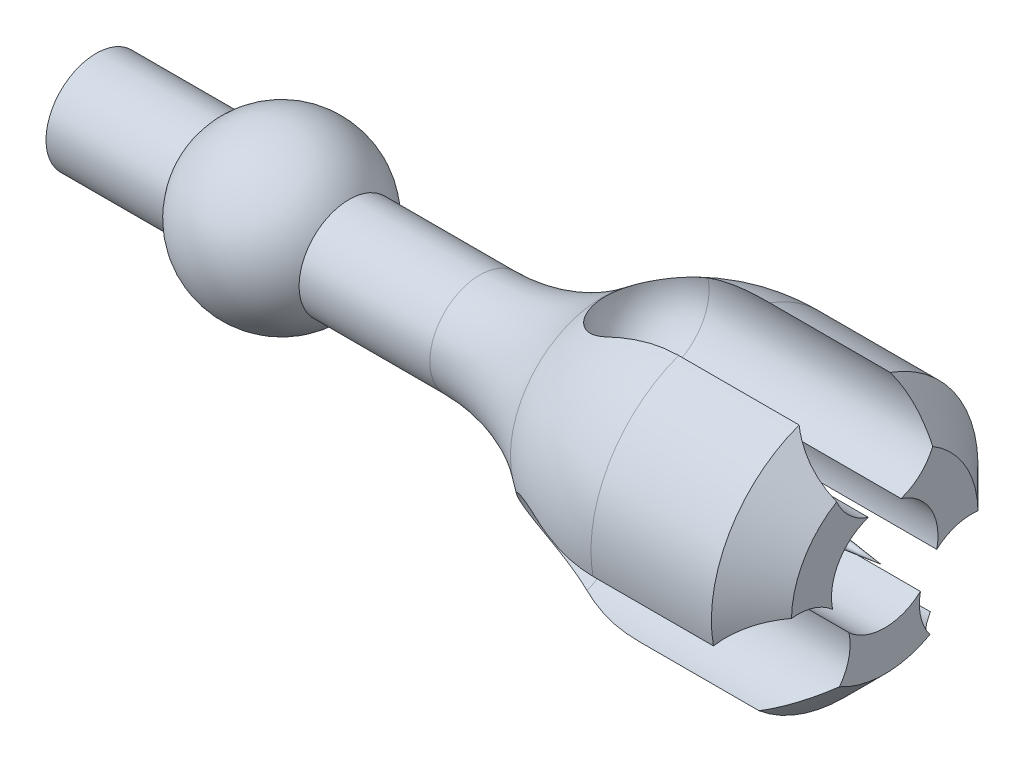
from build123d import *

# Parameters (mm, degrees)
R_P_TITION_CIRCULAIRE1_COUNT = 3
ESQUISSE6_R                  = 25
ENL_V_MAT_EXTRU_1_DEPTH      = 200


with BuildPart() as part:
    # Esquisse1 → Base-R_volution (revolve)
    with BuildSketch(Plane.XY, mode=Mode.PRIVATE) as base_r_volution_sk:
        with BuildLine():
            Line((-250.904378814, 12.5), (-250.904378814, 25))
            Line((-250.904378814, 25), (-265.904378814, 25))
            Line((-265.904378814, 25), (-265.904378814, 3.341254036))
            Line((-265.904378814, 3.341254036), (-276.902975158, 0))
            Line((-276.902975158, 0), (-260.336618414, 0))
            Line((-260.336618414, 0), (52.944413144, 0))
            Line((52.944413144, 0), (119.139924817, 0))
            Line((119.139924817, 0), (52.944413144, 7.948060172))
            Line((52.944413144, 7.948060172), (52.944413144, 13.294030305))
            Line((52.944413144, 13.294030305), (120.083005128, 13.294030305))
            Line((120.083005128, 13.294030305), (120.083005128, 23.294030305))
            Line((120.083005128, 23.294030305), (110.083005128, 33.294030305))
            Line((110.083005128, 33.294030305), (80, 33.294030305))
            ThreePointArc((80, 33.294030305), (63.877798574, 30.623456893), (49.477818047, 22.897015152))
            ThreePointArc((49.477818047, 22.897015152), (35.07783752, 15.170573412), (18.955636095, 12.5))
            Line((18.955636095, 12.5), (-122.08195502, 12.5))
            ThreePointArc((-122.08195502, 12.5), (-135.033788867, 18), (-147.985622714, 12.5))
            Line((-147.985622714, 12.5), (-250.904378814, 12.5))
        make_face()
    revolve(base_r_volution_sk.sketch.rotate(Axis((-149.337642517, 0, 0), (1, 0, 0)), 90), axis=Axis((-149.337642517, 0, 0), (1, 0, 0)))

    # Esquisse3 → Enlever de la mati_re-R_volution1 (revolve, cut)
    with BuildSketch(Plane.XY):
        with BuildLine():
            Line((122.446258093, 25), (122.446258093, 38))
            Line((122.446258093, 38), (63.220391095, 38))
            ThreePointArc((63.220391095, 38), (54.028002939, 34.192388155), (50.220391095, 25))
            Line((50.220391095, 25), (122.446258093, 25))
        make_face()
    enlever_de_la_mati_re_r_volution1 = revolve(axis=Axis((40.642574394, 25, 0), (1, 0, 0)), mode=Mode.SUBTRACT)

    # R_p_tition circulaire1: Enlever de la mati_re-R_volution1 ×3 about axis
    r_p_tition_circulaire1_axis = Axis((0, 0, 0), (1, 0, 0))
    for i in range(1, R_P_TITION_CIRCULAIRE1_COUNT):
        add(enlever_de_la_mati_re_r_volution1.rotate(r_p_tition_circulaire1_axis, i * 360 / R_P_TITION_CIRCULAIRE1_COUNT), mode=Mode.SUBTRACT)

    # Esquisse6 → Enl_v. mat.-Extru.1 (cut)
    with BuildSketch(Plane.ZY.offset(276.902975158)):
        Circle(ESQUISSE6_R)
    extrude(amount=-ENL_V_MAT_EXTRU_1_DEPTH, mode=Mode.SUBTRACT)

    # Esquisse7 → R_volution1 (revolve)
    with BuildSketch(Plane(origin=(-111.389594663, -6.95359368, 0), x_dir=(-1, 0, 0), z_dir=(0, 0, -1))):
        with BuildLine():
            Line((-101.817588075, 6.95359368), (-59.817588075, 6.95359368))
            ThreePointArc((-59.817588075, 6.95359368), (-80.817588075, 27.95359368), (-101.817588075, 6.95359368))
        make_face()
    revolve(axis=Axis((-9.572006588, 0, 0), (-1, 0, 0)))


solid = part.part
